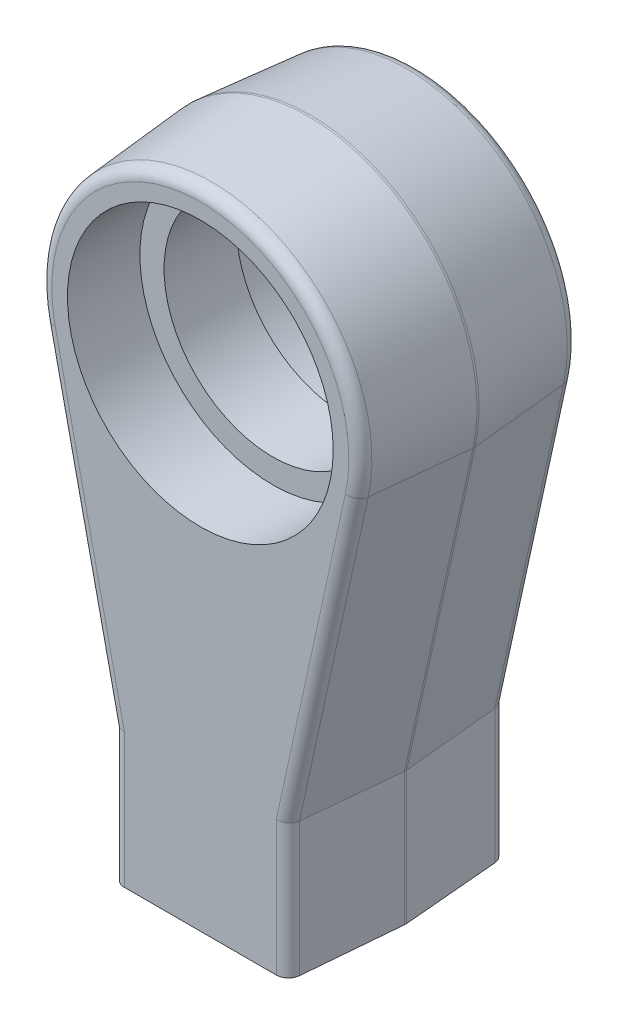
ISO-10303-21;
HEADER;
FILE_DESCRIPTION(('STEP AP214'),'2;1');
FILE_NAME('part.step','',(''),(''),'','','');
FILE_SCHEMA(('AUTOMOTIVE_DESIGN { 1 0 10303 214 1 1 1 1 }'));
ENDSEC;
DATA;
#1=APPLICATION_CONTEXT('core data for automotive mechanical design processes');
#2=APPLICATION_PROTOCOL_DEFINITION('international standard','automotive_design',2000,#1);
#3=PRODUCT_CONTEXT('',#1,'mechanical');
#4=PRODUCT('Part','Part','',(#3));
#5=PRODUCT_RELATED_PRODUCT_CATEGORY('part','',(#4));
#6=PRODUCT_DEFINITION_FORMATION('','',#4);
#7=PRODUCT_DEFINITION_CONTEXT('part definition',#1,'design');
#8=PRODUCT_DEFINITION('design','',#6,#7);
#9=PRODUCT_DEFINITION_SHAPE('','',#8);
#10=(LENGTH_UNIT() NAMED_UNIT(*) SI_UNIT(.MILLI.,.METRE.));
#11=(NAMED_UNIT(*) PLANE_ANGLE_UNIT() SI_UNIT($,.RADIAN.));
#12=(NAMED_UNIT(*) SI_UNIT($,.STERADIAN.) SOLID_ANGLE_UNIT());
#13=UNCERTAINTY_MEASURE_WITH_UNIT(LENGTH_MEASURE(1.E-05),#10,'distance_accuracy_value','');
#14=(GEOMETRIC_REPRESENTATION_CONTEXT(3) GLOBAL_UNCERTAINTY_ASSIGNED_CONTEXT((#13)) GLOBAL_UNIT_ASSIGNED_CONTEXT((#10,
#11,#12)) REPRESENTATION_CONTEXT('',''));
#15=CARTESIAN_POINT('',(0.,0.,0.));
#16=DIRECTION('',(0.,0.,1.));
#17=DIRECTION('',(1.,0.,0.));
#18=AXIS2_PLACEMENT_3D('',#15,#16,#17);
#19=CARTESIAN_POINT('',(0.,0.,-4.5));
#20=DIRECTION('',(0.,0.,1.));
#21=DIRECTION('',(1.,0.,0.));
#22=AXIS2_PLACEMENT_3D('',#19,#20,#21);
#23=CYLINDRICAL_SURFACE('',#22,4.5);
#24=CARTESIAN_POINT('',(0.,0.,1.5));
#25=DIRECTION('',(0.,0.,1.));
#26=DIRECTION('',(1.,0.,0.));
#27=AXIS2_PLACEMENT_3D('',#24,#25,#26);
#28=CIRCLE('',#27,4.5);
#29=CARTESIAN_POINT('',(4.5,0.,1.5));
#30=VERTEX_POINT('',#29);
#31=EDGE_CURVE('E533',#30,#30,#28,.F.);
#32=ORIENTED_EDGE('',*,*,#31,.F.);
#33=EDGE_LOOP('',(#32));
#34=FACE_BOUND('',#33,.T.);
#35=CARTESIAN_POINT('',(0.,0.,-1.5));
#36=DIRECTION('',(0.,0.,-1.));
#37=DIRECTION('',(-1.,0.,0.));
#38=AXIS2_PLACEMENT_3D('',#35,#36,#37);
#39=CIRCLE('',#38,4.5);
#40=CARTESIAN_POINT('',(-4.5,0.,-1.5));
#41=VERTEX_POINT('',#40);
#42=EDGE_CURVE('E537',#41,#41,#39,.F.);
#43=ORIENTED_EDGE('',*,*,#42,.F.);
#44=EDGE_LOOP('',(#43));
#45=FACE_BOUND('',#44,.T.);
#46=ADVANCED_FACE('F350',(#34,#45),#23,.F.);
#47=CARTESIAN_POINT('',(0.,0.,-4.5));
#48=DIRECTION('',(0.,0.,1.));
#49=DIRECTION('',(1.,0.,0.));
#50=AXIS2_PLACEMENT_3D('',#47,#48,#49);
#51=PLANE('',#50);
#52=DIRECTION('',(0.,1.,0.));
#53=VECTOR('',#52,1.);
#54=CARTESIAN_POINT('',(3.14813542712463,-20.1063010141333,-4.5));
#55=LINE('',#54,#53);
#56=CARTESIAN_POINT('',(3.14813542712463,-14.4081168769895,-4.5));
#57=VERTEX_POINT('',#56);
#58=CARTESIAN_POINT('',(3.14813542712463,-20.,-4.5));
#59=VERTEX_POINT('',#58);
#60=EDGE_CURVE('E487',#57,#59,#55,.F.);
#61=ORIENTED_EDGE('',*,*,#60,.T.);
#62=DIRECTION('',(-1.,0.,0.));
#63=VECTOR('',#62,1.);
#64=CARTESIAN_POINT('',(-5.48954240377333,-20.,-4.5));
#65=LINE('',#64,#63);
#66=CARTESIAN_POINT('',(-3.14813542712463,-20.,-4.5));
#67=VERTEX_POINT('',#66);
#68=EDGE_CURVE('E364',#59,#67,#65,.T.);
#69=ORIENTED_EDGE('',*,*,#68,.T.);
#70=DIRECTION('',(0.,-1.,0.));
#71=VECTOR('',#70,1.);
#72=CARTESIAN_POINT('',(-3.14813542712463,-14.4575351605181,-4.5));
#73=LINE('',#72,#71);
#74=CARTESIAN_POINT('',(-3.14813542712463,-14.4081168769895,-4.5));
#75=VERTEX_POINT('',#74);
#76=EDGE_CURVE('E485',#67,#75,#73,.F.);
#77=ORIENTED_EDGE('',*,*,#76,.T.);
#78=DIRECTION('',(0.213241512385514,-0.976999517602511,0.));
#79=VECTOR('',#78,1.);
#80=CARTESIAN_POINT('',(-6.00672534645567,-1.31103769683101,-4.5));
#81=LINE('',#80,#79);
#82=CARTESIAN_POINT('',(-6.00672534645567,-1.31103769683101,-4.5));
#83=VERTEX_POINT('',#82);
#84=EDGE_CURVE('E495',#75,#83,#81,.F.);
#85=ORIENTED_EDGE('',*,*,#84,.T.);
#86=CARTESIAN_POINT('',(0.,0.,-4.5));
#87=DIRECTION('',(0.,0.,1.));
#88=DIRECTION('',(1.,0.,0.));
#89=AXIS2_PLACEMENT_3D('',#86,#87,#88);
#90=CIRCLE('',#89,6.14813542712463);
#91=CARTESIAN_POINT('',(6.00672534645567,-1.31103769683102,-4.5));
#92=VERTEX_POINT('',#91);
#93=EDGE_CURVE('E498',#83,#92,#90,.F.);
#94=ORIENTED_EDGE('',*,*,#93,.T.);
#95=DIRECTION('',(0.213241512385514,0.976999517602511,0.));
#96=VECTOR('',#95,1.);
#97=CARTESIAN_POINT('',(3.15867345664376,-14.3598352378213,-4.5));
#98=LINE('',#97,#96);
#99=EDGE_CURVE('E372',#92,#57,#98,.F.);
#100=ORIENTED_EDGE('',*,*,#99,.T.);
#101=EDGE_LOOP('',(#61,#69,#77,#85,#94,#100));
#102=FACE_BOUND('',#101,.T.);
#103=CARTESIAN_POINT('',(0.,0.,-4.5));
#104=DIRECTION('',(0.,0.,1.));
#105=DIRECTION('',(1.,0.,0.));
#106=AXIS2_PLACEMENT_3D('',#103,#104,#105);
#107=CIRCLE('',#106,5.5);
#108=CARTESIAN_POINT('',(5.5,0.,-4.5));
#109=VERTEX_POINT('',#108);
#110=EDGE_CURVE('E546',#109,#109,#107,.T.);
#111=ORIENTED_EDGE('',*,*,#110,.T.);
#112=EDGE_LOOP('',(#111));
#113=FACE_BOUND('',#112,.T.);
#114=ADVANCED_FACE('F483',(#102,#113),#51,.F.);
#115=CARTESIAN_POINT('',(-4.,-14.5,0.));
#116=DIRECTION('',(-0.996194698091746,0.,0.0871557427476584));
#117=DIRECTION('',(0.0871557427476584,0.,0.996194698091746));
#118=AXIS2_PLACEMENT_3D('',#115,#116,#117);
#119=PLANE('',#118);
#120=DIRECTION('',(0.,-1.,0.));
#121=VECTOR('',#120,1.);
#122=CARTESIAN_POINT('',(-3.9961874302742,-20.5,0.0435778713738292));
#123=LINE('',#122,#121);
#124=CARTESIAN_POINT('',(-3.9961874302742,-14.4995887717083,0.0435778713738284));
#125=VERTEX_POINT('',#124);
#126=CARTESIAN_POINT('',(-3.9961874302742,-20.,0.0435778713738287));
#127=VERTEX_POINT('',#126);
#128=EDGE_CURVE('E525',#125,#127,#123,.T.);
#129=ORIENTED_EDGE('',*,*,#128,.T.);
#130=DIRECTION('',(-0.0871557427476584,0.,-0.996194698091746));
#131=VECTOR('',#130,1.);
#132=CARTESIAN_POINT('',(-4.,-20.,0.));
#133=LINE('',#132,#131);
#134=CARTESIAN_POINT('',(-3.6462327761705,-20.,4.04357787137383));
#135=VERTEX_POINT('',#134);
#136=EDGE_CURVE('E694',#127,#135,#133,.F.);
#137=ORIENTED_EDGE('',*,*,#136,.T.);
#138=DIRECTION('',(0.,-1.,0.));
#139=VECTOR('',#138,1.);
#140=CARTESIAN_POINT('',(-3.6462327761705,-14.4575351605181,4.04357787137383));
#141=LINE('',#140,#139);
#142=CARTESIAN_POINT('',(-3.6462327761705,-14.4618422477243,4.04357787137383));
#143=VERTEX_POINT('',#142);
#144=EDGE_CURVE('E528',#135,#143,#141,.F.);
#145=ORIENTED_EDGE('',*,*,#144,.T.);
#146=DIRECTION('',(-0.0871518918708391,-0.00940030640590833,-0.996150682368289));
#147=VECTOR('',#146,1.);
#148=CARTESIAN_POINT('',(-4.,-14.5,0.));
#149=LINE('',#148,#147);
#150=EDGE_CURVE('E591',#143,#125,#149,.T.);
#151=ORIENTED_EDGE('',*,*,#150,.T.);
#152=EDGE_LOOP('',(#129,#137,#145,#151));
#153=FACE_BOUND('',#152,.T.);
#154=ADVANCED_FACE('F703',(#153),#119,.T.);
#155=CARTESIAN_POINT('',(4.,-14.5,0.));
#156=DIRECTION('',(0.996194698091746,0.,0.0871557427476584));
#157=DIRECTION('',(0.0871557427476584,0.,-0.996194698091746));
#158=AXIS2_PLACEMENT_3D('',#155,#156,#157);
#159=PLANE('',#158);
#160=DIRECTION('',(0.,1.,0.));
#161=VECTOR('',#160,1.);
#162=CARTESIAN_POINT('',(3.6462327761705,-20.1063010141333,4.04357787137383));
#163=LINE('',#162,#161);
#164=CARTESIAN_POINT('',(3.6462327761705,-14.4618422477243,4.04357787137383));
#165=VERTEX_POINT('',#164);
#166=CARTESIAN_POINT('',(3.6462327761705,-20.,4.04357787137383));
#167=VERTEX_POINT('',#166);
#168=EDGE_CURVE('E517',#165,#167,#163,.F.);
#169=ORIENTED_EDGE('',*,*,#168,.T.);
#170=DIRECTION('',(-0.0871557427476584,0.,0.996194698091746));
#171=VECTOR('',#170,1.);
#172=CARTESIAN_POINT('',(4.,-20.,0.));
#173=LINE('',#172,#171);
#174=CARTESIAN_POINT('',(3.9961874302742,-20.,0.0435778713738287));
#175=VERTEX_POINT('',#174);
#176=EDGE_CURVE('E685',#167,#175,#173,.F.);
#177=ORIENTED_EDGE('',*,*,#176,.T.);
#178=DIRECTION('',(0.,1.,0.));
#179=VECTOR('',#178,1.);
#180=CARTESIAN_POINT('',(3.9961874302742,-14.5,0.0435778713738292));
#181=LINE('',#180,#179);
#182=CARTESIAN_POINT('',(3.9961874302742,-14.4995887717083,0.0435778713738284));
#183=VERTEX_POINT('',#182);
#184=EDGE_CURVE('E515',#175,#183,#181,.T.);
#185=ORIENTED_EDGE('',*,*,#184,.T.);
#186=DIRECTION('',(0.0871518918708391,-0.00940030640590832,-0.996150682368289));
#187=VECTOR('',#186,1.);
#188=CARTESIAN_POINT('',(4.,-14.5,0.));
#189=LINE('',#188,#187);
#190=EDGE_CURVE('E608',#165,#183,#189,.T.);
#191=ORIENTED_EDGE('',*,*,#190,.F.);
#192=EDGE_LOOP('',(#169,#177,#185,#191));
#193=FACE_BOUND('',#192,.T.);
#194=ADVANCED_FACE('F352',(#193),#159,.T.);
#195=CARTESIAN_POINT('',(4.,-14.5,0.));
#196=DIRECTION('',(0.973281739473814,-0.212430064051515,0.0871557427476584));
#197=DIRECTION('',(0.213241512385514,0.976999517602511,0.));
#198=AXIS2_PLACEMENT_3D('',#195,#196,#197);
#199=PLANE('',#198);
#200=DIRECTION('',(0.0851511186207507,-0.0185852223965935,-0.996194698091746));
#201=VECTOR('',#200,1.);
#202=CARTESIAN_POINT('',(6.83899662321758,-1.4926905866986,0.));
#203=LINE('',#202,#201);
#204=CARTESIAN_POINT('',(6.49336621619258,-1.41725272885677,4.04357787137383));
#205=VERTEX_POINT('',#204);
#206=CARTESIAN_POINT('',(6.83527174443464,-1.4918775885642,0.0435778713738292));
#207=VERTEX_POINT('',#206);
#208=EDGE_CURVE('E605',#205,#207,#203,.T.);
#209=ORIENTED_EDGE('',*,*,#208,.F.);
#210=DIRECTION('',(0.213241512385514,0.976999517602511,0.));
#211=VECTOR('',#210,1.);
#212=CARTESIAN_POINT('',(3.64531432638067,-14.4660502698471,4.04357787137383));
#213=LINE('',#212,#211);
#214=EDGE_CURVE('E626',#205,#165,#213,.F.);
#215=ORIENTED_EDGE('',*,*,#214,.T.);
#216=ORIENTED_EDGE('',*,*,#190,.T.);
#217=DIRECTION('',(0.213241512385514,0.976999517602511,0.));
#218=VECTOR('',#217,1.);
#219=CARTESIAN_POINT('',(6.83527174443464,-1.49187758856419,0.0435778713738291));
#220=LINE('',#219,#218);
#221=EDGE_CURVE('E623',#183,#207,#220,.T.);
#222=ORIENTED_EDGE('',*,*,#221,.T.);
#223=EDGE_LOOP('',(#209,#215,#216,#222));
#224=FACE_BOUND('',#223,.T.);
#225=ADVANCED_FACE('F723',(#224),#199,.T.);
#226=CARTESIAN_POINT('',(0.,0.,0.));
#227=DIRECTION('',(0.,0.,-1.));
#228=DIRECTION('',(1.,0.,0.));
#229=AXIS2_PLACEMENT_3D('',#226,#227,#228);
#230=CONICAL_SURFACE('',#229,7.,0.0872664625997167);
#231=DIRECTION('',(-0.0851511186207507,-0.0185852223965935,-0.996194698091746));
#232=VECTOR('',#231,1.);
#233=CARTESIAN_POINT('',(-6.83899662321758,-1.4926905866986,0.));
#234=LINE('',#233,#232);
#235=CARTESIAN_POINT('',(-6.49336621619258,-1.41725272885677,4.04357787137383));
#236=VERTEX_POINT('',#235);
#237=CARTESIAN_POINT('',(-6.83527174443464,-1.49187758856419,0.0435778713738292));
#238=VERTEX_POINT('',#237);
#239=EDGE_CURVE('E602',#236,#238,#234,.T.);
#240=ORIENTED_EDGE('',*,*,#239,.F.);
#241=CARTESIAN_POINT('',(0.,0.,4.04357787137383));
#242=DIRECTION('',(0.,0.,-1.));
#243=DIRECTION('',(-1.,0.,0.));
#244=AXIS2_PLACEMENT_3D('',#241,#242,#243);
#245=CIRCLE('',#244,6.64623277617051);
#246=EDGE_CURVE('E509',#236,#205,#245,.T.);
#247=ORIENTED_EDGE('',*,*,#246,.T.);
#248=ORIENTED_EDGE('',*,*,#208,.T.);
#249=CARTESIAN_POINT('',(0.,0.,0.0435778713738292));
#250=DIRECTION('',(0.,0.,-1.));
#251=DIRECTION('',(-1.,0.,0.));
#252=AXIS2_PLACEMENT_3D('',#249,#250,#251);
#253=CIRCLE('',#252,6.9961874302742);
#254=EDGE_CURVE('E507',#207,#238,#253,.F.);
#255=ORIENTED_EDGE('',*,*,#254,.T.);
#256=EDGE_LOOP('',(#240,#247,#248,#255));
#257=FACE_BOUND('',#256,.T.);
#258=ADVANCED_FACE('F719',(#257),#230,.T.);
#259=CARTESIAN_POINT('',(-4.,-14.5,0.));
#260=DIRECTION('',(-0.973281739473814,-0.212430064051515,0.0871557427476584));
#261=DIRECTION('',(0.213241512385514,-0.976999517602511,0.));
#262=AXIS2_PLACEMENT_3D('',#259,#260,#261);
#263=PLANE('',#262);
#264=ORIENTED_EDGE('',*,*,#150,.F.);
#265=DIRECTION('',(0.213241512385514,-0.976999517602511,0.));
#266=VECTOR('',#265,1.);
#267=CARTESIAN_POINT('',(-6.49336621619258,-1.41725272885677,4.04357787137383));
#268=LINE('',#267,#266);
#269=EDGE_CURVE('E630',#143,#236,#268,.F.);
#270=ORIENTED_EDGE('',*,*,#269,.T.);
#271=ORIENTED_EDGE('',*,*,#239,.T.);
#272=DIRECTION('',(0.213241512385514,-0.976999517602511,0.));
#273=VECTOR('',#272,1.);
#274=CARTESIAN_POINT('',(-3.99627512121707,-14.4991870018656,0.0435778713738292));
#275=LINE('',#274,#273);
#276=EDGE_CURVE('E628',#238,#125,#275,.T.);
#277=ORIENTED_EDGE('',*,*,#276,.T.);
#278=EDGE_LOOP('',(#264,#270,#271,#277));
#279=FACE_BOUND('',#278,.T.);
#280=ADVANCED_FACE('F716',(#279),#263,.T.);
#281=CARTESIAN_POINT('',(0.,0.,4.5));
#282=DIRECTION('',(0.,0.,1.));
#283=DIRECTION('',(1.,0.,0.));
#284=AXIS2_PLACEMENT_3D('',#281,#282,#283);
#285=PLANE('',#284);
#286=DIRECTION('',(-1.,0.,0.));
#287=VECTOR('',#286,1.);
#288=CARTESIAN_POINT('',(-5.48954240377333,-20.,4.5));
#289=LINE('',#288,#287);
#290=CARTESIAN_POINT('',(3.14813542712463,-20.,4.5));
#291=VERTEX_POINT('',#290);
#292=CARTESIAN_POINT('',(-3.14813542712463,-20.,4.5));
#293=VERTEX_POINT('',#292);
#294=EDGE_CURVE('E489',#291,#293,#289,.T.);
#295=ORIENTED_EDGE('',*,*,#294,.F.);
#296=DIRECTION('',(0.,-1.,0.));
#297=VECTOR('',#296,1.);
#298=CARTESIAN_POINT('',(3.14813542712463,-14.4575351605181,4.5));
#299=LINE('',#298,#297);
#300=CARTESIAN_POINT('',(3.14813542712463,-14.4081168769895,4.5));
#301=VERTEX_POINT('',#300);
#302=EDGE_CURVE('E621',#291,#301,#299,.F.);
#303=ORIENTED_EDGE('',*,*,#302,.T.);
#304=DIRECTION('',(-0.213241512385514,-0.976999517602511,0.));
#305=VECTOR('',#304,1.);
#306=CARTESIAN_POINT('',(6.00672534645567,-1.31103769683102,4.5));
#307=LINE('',#306,#305);
#308=CARTESIAN_POINT('',(6.00672534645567,-1.31103769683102,4.5));
#309=VERTEX_POINT('',#308);
#310=EDGE_CURVE('E618',#301,#309,#307,.F.);
#311=ORIENTED_EDGE('',*,*,#310,.T.);
#312=CARTESIAN_POINT('',(0.,0.,4.5));
#313=DIRECTION('',(0.,0.,1.));
#314=DIRECTION('',(1.,0.,0.));
#315=AXIS2_PLACEMENT_3D('',#312,#313,#314);
#316=CIRCLE('',#315,6.14813542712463);
#317=CARTESIAN_POINT('',(-6.00672534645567,-1.31103769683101,4.5));
#318=VERTEX_POINT('',#317);
#319=EDGE_CURVE('E616',#309,#318,#316,.T.);
#320=ORIENTED_EDGE('',*,*,#319,.T.);
#321=DIRECTION('',(-0.213241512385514,0.976999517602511,0.));
#322=VECTOR('',#321,1.);
#323=CARTESIAN_POINT('',(-3.15867345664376,-14.3598352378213,4.5));
#324=LINE('',#323,#322);
#325=CARTESIAN_POINT('',(-3.14813542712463,-14.4081168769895,4.5));
#326=VERTEX_POINT('',#325);
#327=EDGE_CURVE('E614',#318,#326,#324,.F.);
#328=ORIENTED_EDGE('',*,*,#327,.T.);
#329=DIRECTION('',(0.,1.,0.));
#330=VECTOR('',#329,1.);
#331=CARTESIAN_POINT('',(-3.14813542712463,-20.1063010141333,4.5));
#332=LINE('',#331,#330);
#333=EDGE_CURVE('E611',#326,#293,#332,.F.);
#334=ORIENTED_EDGE('',*,*,#333,.T.);
#335=EDGE_LOOP('',(#295,#303,#311,#320,#328,#334));
#336=FACE_BOUND('',#335,.T.);
#337=CARTESIAN_POINT('',(0.,0.,4.5));
#338=DIRECTION('',(0.,0.,1.));
#339=DIRECTION('',(1.,0.,0.));
#340=AXIS2_PLACEMENT_3D('',#337,#338,#339);
#341=CIRCLE('',#340,5.5);
#342=CARTESIAN_POINT('',(5.5,0.,4.5));
#343=VERTEX_POINT('',#342);
#344=EDGE_CURVE('E539',#343,#343,#341,.T.);
#345=ORIENTED_EDGE('',*,*,#344,.F.);
#346=EDGE_LOOP('',(#345));
#347=FACE_BOUND('',#346,.T.);
#348=ADVANCED_FACE('F734',(#336,#347),#285,.T.);
#349=CARTESIAN_POINT('',(-4.,-14.5,0.));
#350=DIRECTION('',(-0.996194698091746,0.,-0.0871557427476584));
#351=DIRECTION('',(-0.0871557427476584,0.,0.996194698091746));
#352=AXIS2_PLACEMENT_3D('',#349,#350,#351);
#353=PLANE('',#352);
#354=DIRECTION('',(0.0871557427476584,0.,-0.996194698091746));
#355=VECTOR('',#354,1.);
#356=CARTESIAN_POINT('',(-4.,-20.,0.));
#357=LINE('',#356,#355);
#358=CARTESIAN_POINT('',(-3.9961874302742,-20.,-0.0435778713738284));
#359=VERTEX_POINT('',#358);
#360=CARTESIAN_POINT('',(-3.6462327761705,-20.,-4.04357787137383));
#361=VERTEX_POINT('',#360);
#362=EDGE_CURVE('E476',#359,#361,#357,.T.);
#363=ORIENTED_EDGE('',*,*,#362,.F.);
#364=DIRECTION('',(0.,1.,0.));
#365=VECTOR('',#364,1.);
#366=CARTESIAN_POINT('',(-3.9961874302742,-14.5,-0.0435778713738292));
#367=LINE('',#366,#365);
#368=CARTESIAN_POINT('',(-3.9961874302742,-14.4995887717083,-0.0435778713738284));
#369=VERTEX_POINT('',#368);
#370=EDGE_CURVE('E530',#359,#369,#367,.T.);
#371=ORIENTED_EDGE('',*,*,#370,.T.);
#372=DIRECTION('',(-0.0871518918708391,-0.00940030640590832,0.996150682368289));
#373=VECTOR('',#372,1.);
#374=CARTESIAN_POINT('',(-4.,-14.5,0.));
#375=LINE('',#374,#373);
#376=CARTESIAN_POINT('',(-3.6462327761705,-14.4618422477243,-4.04357787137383));
#377=VERTEX_POINT('',#376);
#378=EDGE_CURVE('E588',#377,#369,#375,.T.);
#379=ORIENTED_EDGE('',*,*,#378,.F.);
#380=DIRECTION('',(0.,-1.,0.));
#381=VECTOR('',#380,1.);
#382=CARTESIAN_POINT('',(-3.6462327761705,-20.1063010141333,-4.04357787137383));
#383=LINE('',#382,#381);
#384=EDGE_CURVE('E358',#377,#361,#383,.T.);
#385=ORIENTED_EDGE('',*,*,#384,.T.);
#386=EDGE_LOOP('',(#363,#371,#379,#385));
#387=FACE_BOUND('',#386,.T.);
#388=ADVANCED_FACE('F645',(#387),#353,.T.);
#389=CARTESIAN_POINT('',(-4.,-14.5,0.));
#390=DIRECTION('',(-0.973281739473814,-0.212430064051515,-0.0871557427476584));
#391=DIRECTION('',(0.213241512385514,-0.976999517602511,0.));
#392=AXIS2_PLACEMENT_3D('',#389,#390,#391);
#393=PLANE('',#392);
#394=ORIENTED_EDGE('',*,*,#378,.T.);
#395=DIRECTION('',(-0.213241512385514,0.976999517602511,0.));
#396=VECTOR('',#395,1.);
#397=CARTESIAN_POINT('',(-6.83527174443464,-1.49187758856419,-0.0435778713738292));
#398=LINE('',#397,#396);
#399=CARTESIAN_POINT('',(-6.83527174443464,-1.49187758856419,-0.0435778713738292));
#400=VERTEX_POINT('',#399);
#401=EDGE_CURVE('E496',#369,#400,#398,.T.);
#402=ORIENTED_EDGE('',*,*,#401,.T.);
#403=DIRECTION('',(-0.0851511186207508,-0.0185852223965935,0.996194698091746));
#404=VECTOR('',#403,1.);
#405=CARTESIAN_POINT('',(-6.83899662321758,-1.4926905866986,0.));
#406=LINE('',#405,#404);
#407=CARTESIAN_POINT('',(-6.49336621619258,-1.41725272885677,-4.04357787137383));
#408=VERTEX_POINT('',#407);
#409=EDGE_CURVE('E592',#408,#400,#406,.T.);
#410=ORIENTED_EDGE('',*,*,#409,.F.);
#411=DIRECTION('',(0.213241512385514,-0.976999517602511,0.));
#412=VECTOR('',#411,1.);
#413=CARTESIAN_POINT('',(-3.64531432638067,-14.4660502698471,-4.04357787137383));
#414=LINE('',#413,#412);
#415=EDGE_CURVE('E500',#408,#377,#414,.T.);
#416=ORIENTED_EDGE('',*,*,#415,.T.);
#417=EDGE_LOOP('',(#394,#402,#410,#416));
#418=FACE_BOUND('',#417,.T.);
#419=ADVANCED_FACE('F640',(#418),#393,.T.);
#420=CARTESIAN_POINT('',(0.,0.,0.));
#421=DIRECTION('',(0.,0.,1.));
#422=DIRECTION('',(1.,0.,0.));
#423=AXIS2_PLACEMENT_3D('',#420,#421,#422);
#424=CONICAL_SURFACE('',#423,7.,0.0872664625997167);
#425=ORIENTED_EDGE('',*,*,#409,.T.);
#426=CARTESIAN_POINT('',(0.,0.,-0.0435778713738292));
#427=DIRECTION('',(0.,0.,1.));
#428=DIRECTION('',(1.,0.,0.));
#429=AXIS2_PLACEMENT_3D('',#426,#427,#428);
#430=CIRCLE('',#429,6.9961874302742);
#431=CARTESIAN_POINT('',(6.83527174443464,-1.49187758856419,-0.0435778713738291));
#432=VERTEX_POINT('',#431);
#433=EDGE_CURVE('E513',#400,#432,#430,.F.);
#434=ORIENTED_EDGE('',*,*,#433,.T.);
#435=DIRECTION('',(0.0851511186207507,-0.0185852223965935,0.996194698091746));
#436=VECTOR('',#435,1.);
#437=CARTESIAN_POINT('',(6.83899662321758,-1.4926905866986,0.));
#438=LINE('',#437,#436);
#439=CARTESIAN_POINT('',(6.49336621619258,-1.41725272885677,-4.04357787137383));
#440=VERTEX_POINT('',#439);
#441=EDGE_CURVE('E595',#440,#432,#438,.T.);
#442=ORIENTED_EDGE('',*,*,#441,.F.);
#443=CARTESIAN_POINT('',(0.,0.,-4.04357787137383));
#444=DIRECTION('',(0.,0.,1.));
#445=DIRECTION('',(1.,0.,0.));
#446=AXIS2_PLACEMENT_3D('',#443,#444,#445);
#447=CIRCLE('',#446,6.64623277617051);
#448=EDGE_CURVE('E511',#440,#408,#447,.T.);
#449=ORIENTED_EDGE('',*,*,#448,.T.);
#450=EDGE_LOOP('',(#425,#434,#442,#449));
#451=FACE_BOUND('',#450,.T.);
#452=ADVANCED_FACE('F663',(#451),#424,.T.);
#453=CARTESIAN_POINT('',(4.,-14.5,0.));
#454=DIRECTION('',(0.973281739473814,-0.212430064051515,-0.0871557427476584));
#455=DIRECTION('',(0.213241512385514,0.976999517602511,0.));
#456=AXIS2_PLACEMENT_3D('',#453,#454,#455);
#457=PLANE('',#456);
#458=ORIENTED_EDGE('',*,*,#441,.T.);
#459=DIRECTION('',(-0.213241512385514,-0.976999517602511,0.));
#460=VECTOR('',#459,1.);
#461=CARTESIAN_POINT('',(3.99627512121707,-14.4991870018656,-0.0435778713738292));
#462=LINE('',#461,#460);
#463=CARTESIAN_POINT('',(3.9961874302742,-14.4995887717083,-0.0435778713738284));
#464=VERTEX_POINT('',#463);
#465=EDGE_CURVE('E635',#432,#464,#462,.T.);
#466=ORIENTED_EDGE('',*,*,#465,.T.);
#467=DIRECTION('',(0.0871518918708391,-0.00940030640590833,0.996150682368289));
#468=VECTOR('',#467,1.);
#469=CARTESIAN_POINT('',(4.,-14.5,0.));
#470=LINE('',#469,#468);
#471=CARTESIAN_POINT('',(3.6462327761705,-14.4618422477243,-4.04357787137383));
#472=VERTEX_POINT('',#471);
#473=EDGE_CURVE('E587',#472,#464,#470,.T.);
#474=ORIENTED_EDGE('',*,*,#473,.F.);
#475=DIRECTION('',(0.213241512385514,0.976999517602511,0.));
#476=VECTOR('',#475,1.);
#477=CARTESIAN_POINT('',(6.49336621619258,-1.41725272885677,-4.04357787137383));
#478=LINE('',#477,#476);
#479=EDGE_CURVE('E632',#472,#440,#478,.T.);
#480=ORIENTED_EDGE('',*,*,#479,.T.);
#481=EDGE_LOOP('',(#458,#466,#474,#480));
#482=FACE_BOUND('',#481,.T.);
#483=ADVANCED_FACE('F661',(#482),#457,.T.);
#484=CARTESIAN_POINT('',(4.,-14.5,0.));
#485=DIRECTION('',(0.996194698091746,0.,-0.0871557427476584));
#486=DIRECTION('',(-0.0871557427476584,0.,-0.996194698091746));
#487=AXIS2_PLACEMENT_3D('',#484,#485,#486);
#488=PLANE('',#487);
#489=DIRECTION('',(0.0871557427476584,0.,0.996194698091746));
#490=VECTOR('',#489,1.);
#491=CARTESIAN_POINT('',(4.,-20.,0.));
#492=LINE('',#491,#490);
#493=CARTESIAN_POINT('',(3.6462327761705,-20.,-4.04357787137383));
#494=VERTEX_POINT('',#493);
#495=CARTESIAN_POINT('',(3.9961874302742,-20.,-0.0435778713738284));
#496=VERTEX_POINT('',#495);
#497=EDGE_CURVE('E488',#494,#496,#492,.T.);
#498=ORIENTED_EDGE('',*,*,#497,.F.);
#499=DIRECTION('',(0.,1.,0.));
#500=VECTOR('',#499,1.);
#501=CARTESIAN_POINT('',(3.6462327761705,-14.4575351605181,-4.04357787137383));
#502=LINE('',#501,#500);
#503=EDGE_CURVE('E520',#494,#472,#502,.T.);
#504=ORIENTED_EDGE('',*,*,#503,.T.);
#505=ORIENTED_EDGE('',*,*,#473,.T.);
#506=DIRECTION('',(0.,-1.,0.));
#507=VECTOR('',#506,1.);
#508=CARTESIAN_POINT('',(3.9961874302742,-20.5,-0.0435778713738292));
#509=LINE('',#508,#507);
#510=EDGE_CURVE('E522',#464,#496,#509,.T.);
#511=ORIENTED_EDGE('',*,*,#510,.T.);
#512=EDGE_LOOP('',(#498,#504,#505,#511));
#513=FACE_BOUND('',#512,.T.);
#514=ADVANCED_FACE('F677',(#513),#488,.T.);
#515=CARTESIAN_POINT('',(-3.14813542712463,0.,4.));
#516=DIRECTION('',(0.,-1.,0.));
#517=DIRECTION('',(1.,0.,0.));
#518=AXIS2_PLACEMENT_3D('',#515,#516,#517);
#519=CYLINDRICAL_SURFACE('',#518,0.5);
#520=CARTESIAN_POINT('',(-3.14813542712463,-20.,4.));
#521=DIRECTION('',(0.,1.,0.));
#522=DIRECTION('',(0.,0.,1.));
#523=AXIS2_PLACEMENT_3D('',#520,#521,#522);
#524=CIRCLE('',#523,0.5);
#525=EDGE_CURVE('E551',#293,#135,#524,.F.);
#526=ORIENTED_EDGE('',*,*,#525,.F.);
#527=ORIENTED_EDGE('',*,*,#333,.F.);
#528=CARTESIAN_POINT('',(-3.14813542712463,-14.4081168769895,4.));
#529=DIRECTION('',(0.107239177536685,-0.994233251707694,0.));
#530=DIRECTION('',(0.994233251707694,0.107239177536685,0.));
#531=AXIS2_PLACEMENT_3D('',#528,#529,#530);
#532=ELLIPSE('',#531,0.502900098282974,0.5);
#533=EDGE_CURVE('E584',#143,#326,#532,.F.);
#534=ORIENTED_EDGE('',*,*,#533,.F.);
#535=ORIENTED_EDGE('',*,*,#144,.F.);
#536=EDGE_LOOP('',(#526,#527,#534,#535));
#537=FACE_BOUND('',#536,.T.);
#538=ADVANCED_FACE('F707',(#537),#519,.T.);
#539=CARTESIAN_POINT('',(-6.00672534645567,-1.31103769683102,4.));
#540=DIRECTION('',(0.213241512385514,-0.976999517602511,0.));
#541=DIRECTION('',(0.976999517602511,0.213241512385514,0.));
#542=AXIS2_PLACEMENT_3D('',#539,#540,#541);
#543=CYLINDRICAL_SURFACE('',#542,0.5);
#544=ORIENTED_EDGE('',*,*,#533,.T.);
#545=ORIENTED_EDGE('',*,*,#327,.F.);
#546=CARTESIAN_POINT('',(-6.00672534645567,-1.31103769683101,4.));
#547=DIRECTION('',(-0.213241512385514,0.976999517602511,0.));
#548=DIRECTION('',(-0.976999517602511,-0.213241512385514,0.));
#549=AXIS2_PLACEMENT_3D('',#546,#547,#548);
#550=CIRCLE('',#549,0.5);
#551=EDGE_CURVE('E581',#236,#318,#550,.T.);
#552=ORIENTED_EDGE('',*,*,#551,.F.);
#553=ORIENTED_EDGE('',*,*,#269,.F.);
#554=EDGE_LOOP('',(#544,#545,#552,#553));
#555=FACE_BOUND('',#554,.T.);
#556=ADVANCED_FACE('F712',(#555),#543,.T.);
#557=CARTESIAN_POINT('',(3.14813542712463,0.,4.));
#558=DIRECTION('',(0.,1.,0.));
#559=DIRECTION('',(-1.,0.,0.));
#560=AXIS2_PLACEMENT_3D('',#557,#558,#559);
#561=CYLINDRICAL_SURFACE('',#560,0.5);
#562=CARTESIAN_POINT('',(3.14813542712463,-20.,4.));
#563=DIRECTION('',(0.,1.,0.));
#564=DIRECTION('',(0.,0.,1.));
#565=AXIS2_PLACEMENT_3D('',#562,#563,#564);
#566=CIRCLE('',#565,0.5);
#567=EDGE_CURVE('E481',#167,#291,#566,.F.);
#568=ORIENTED_EDGE('',*,*,#567,.F.);
#569=ORIENTED_EDGE('',*,*,#168,.F.);
#570=CARTESIAN_POINT('',(3.14813542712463,-14.4081168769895,4.));
#571=DIRECTION('',(0.107239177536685,0.994233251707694,0.));
#572=DIRECTION('',(0.994233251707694,-0.107239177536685,0.));
#573=AXIS2_PLACEMENT_3D('',#570,#571,#572);
#574=ELLIPSE('',#573,0.502900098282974,0.5);
#575=EDGE_CURVE('E578',#301,#165,#574,.T.);
#576=ORIENTED_EDGE('',*,*,#575,.F.);
#577=ORIENTED_EDGE('',*,*,#302,.F.);
#578=EDGE_LOOP('',(#568,#569,#576,#577));
#579=FACE_BOUND('',#578,.T.);
#580=ADVANCED_FACE('F740',(#579),#561,.T.);
#581=CARTESIAN_POINT('',(0.,0.,4.));
#582=DIRECTION('',(0.,0.,1.));
#583=DIRECTION('',(1.,0.,0.));
#584=AXIS2_PLACEMENT_3D('',#581,#582,#583);
#585=TOROIDAL_SURFACE('',#584,6.14813542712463,0.5);
#586=ORIENTED_EDGE('',*,*,#551,.T.);
#587=ORIENTED_EDGE('',*,*,#319,.F.);
#588=CARTESIAN_POINT('',(6.00672534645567,-1.31103769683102,4.));
#589=DIRECTION('',(-0.213241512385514,-0.976999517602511,0.));
#590=DIRECTION('',(0.976999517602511,-0.213241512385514,0.));
#591=AXIS2_PLACEMENT_3D('',#588,#589,#590);
#592=CIRCLE('',#591,0.5);
#593=EDGE_CURVE('E576',#205,#309,#592,.T.);
#594=ORIENTED_EDGE('',*,*,#593,.F.);
#595=ORIENTED_EDGE('',*,*,#246,.F.);
#596=EDGE_LOOP('',(#586,#587,#594,#595));
#597=FACE_BOUND('',#596,.T.);
#598=ADVANCED_FACE('F732',(#597),#585,.T.);
#599=CARTESIAN_POINT('',(6.00672534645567,-1.31103769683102,4.));
#600=DIRECTION('',(0.213241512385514,0.976999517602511,0.));
#601=DIRECTION('',(-0.976999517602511,0.213241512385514,0.));
#602=AXIS2_PLACEMENT_3D('',#599,#600,#601);
#603=CYLINDRICAL_SURFACE('',#602,0.5);
#604=ORIENTED_EDGE('',*,*,#575,.T.);
#605=ORIENTED_EDGE('',*,*,#214,.F.);
#606=ORIENTED_EDGE('',*,*,#593,.T.);
#607=ORIENTED_EDGE('',*,*,#310,.F.);
#608=EDGE_LOOP('',(#604,#605,#606,#607));
#609=FACE_BOUND('',#608,.T.);
#610=ADVANCED_FACE('F727',(#609),#603,.T.);
#611=CARTESIAN_POINT('',(-3.49809008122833,-14.5,0.));
#612=DIRECTION('',(0.,-1.,0.));
#613=DIRECTION('',(1.,0.,0.));
#614=AXIS2_PLACEMENT_3D('',#611,#612,#613);
#615=CYLINDRICAL_SURFACE('',#614,0.5);
#616=CARTESIAN_POINT('',(-3.49809008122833,-20.,0.));
#617=DIRECTION('',(0.,1.,0.));
#618=DIRECTION('',(0.,0.,1.));
#619=AXIS2_PLACEMENT_3D('',#616,#617,#618);
#620=CIRCLE('',#619,0.5);
#621=EDGE_CURVE('E692',#127,#359,#620,.F.);
#622=ORIENTED_EDGE('',*,*,#621,.F.);
#623=ORIENTED_EDGE('',*,*,#128,.F.);
#624=CARTESIAN_POINT('',(-3.49809008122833,-14.4458634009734,0.));
#625=DIRECTION('',(0.107239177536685,-0.994233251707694,0.));
#626=DIRECTION('',(0.994233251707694,0.107239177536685,0.));
#627=AXIS2_PLACEMENT_3D('',#624,#625,#626);
#628=ELLIPSE('',#627,0.502900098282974,0.5);
#629=EDGE_CURVE('E573',#369,#125,#628,.F.);
#630=ORIENTED_EDGE('',*,*,#629,.F.);
#631=ORIENTED_EDGE('',*,*,#370,.F.);
#632=EDGE_LOOP('',(#622,#623,#630,#631));
#633=FACE_BOUND('',#632,.T.);
#634=ADVANCED_FACE('F783',(#633),#615,.T.);
#635=CARTESIAN_POINT('',(-3.50963425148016,-14.3929719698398,0.));
#636=DIRECTION('',(0.213241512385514,-0.976999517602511,0.));
#637=DIRECTION('',(0.976999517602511,0.213241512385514,0.));
#638=AXIS2_PLACEMENT_3D('',#635,#636,#637);
#639=CYLINDRICAL_SURFACE('',#638,0.5);
#640=ORIENTED_EDGE('',*,*,#629,.T.);
#641=ORIENTED_EDGE('',*,*,#276,.F.);
#642=CARTESIAN_POINT('',(-6.34863087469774,-1.38566255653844,0.));
#643=DIRECTION('',(-0.213241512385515,0.97699951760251,0.));
#644=DIRECTION('',(-0.97699951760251,-0.213241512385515,0.));
#645=AXIS2_PLACEMENT_3D('',#642,#643,#644);
#646=CIRCLE('',#645,0.5);
#647=EDGE_CURVE('E570',#400,#238,#646,.T.);
#648=ORIENTED_EDGE('',*,*,#647,.F.);
#649=ORIENTED_EDGE('',*,*,#401,.F.);
#650=EDGE_LOOP('',(#640,#641,#648,#649));
#651=FACE_BOUND('',#650,.T.);
#652=ADVANCED_FACE('F780',(#651),#639,.T.);
#653=CARTESIAN_POINT('',(3.49809008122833,-14.5,0.));
#654=DIRECTION('',(0.,1.,0.));
#655=DIRECTION('',(-1.,0.,0.));
#656=AXIS2_PLACEMENT_3D('',#653,#654,#655);
#657=CYLINDRICAL_SURFACE('',#656,0.5);
#658=CARTESIAN_POINT('',(3.49809008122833,-20.,0.));
#659=DIRECTION('',(0.,1.,0.));
#660=DIRECTION('',(0.,0.,1.));
#661=AXIS2_PLACEMENT_3D('',#658,#659,#660);
#662=CIRCLE('',#661,0.5);
#663=EDGE_CURVE('E683',#496,#175,#662,.F.);
#664=ORIENTED_EDGE('',*,*,#663,.F.);
#665=ORIENTED_EDGE('',*,*,#510,.F.);
#666=CARTESIAN_POINT('',(3.49809008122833,-14.4458634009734,0.));
#667=DIRECTION('',(0.107239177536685,0.994233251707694,0.));
#668=DIRECTION('',(0.994233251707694,-0.107239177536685,0.));
#669=AXIS2_PLACEMENT_3D('',#666,#667,#668);
#670=ELLIPSE('',#669,0.502900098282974,0.5);
#671=EDGE_CURVE('E567',#183,#464,#670,.T.);
#672=ORIENTED_EDGE('',*,*,#671,.F.);
#673=ORIENTED_EDGE('',*,*,#184,.F.);
#674=EDGE_LOOP('',(#664,#665,#672,#673));
#675=FACE_BOUND('',#674,.T.);
#676=ADVANCED_FACE('F681',(#675),#657,.T.);
#677=CARTESIAN_POINT('',(0.,0.,0.));
#678=DIRECTION('',(0.,0.,-1.));
#679=DIRECTION('',(-1.,0.,0.));
#680=AXIS2_PLACEMENT_3D('',#677,#678,#679);
#681=TOROIDAL_SURFACE('',#680,6.49809008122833,0.5);
#682=ORIENTED_EDGE('',*,*,#647,.T.);
#683=ORIENTED_EDGE('',*,*,#254,.F.);
#684=CARTESIAN_POINT('',(6.34863087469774,-1.38566255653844,0.));
#685=DIRECTION('',(-0.213241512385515,-0.97699951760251,0.));
#686=DIRECTION('',(0.97699951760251,-0.213241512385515,0.));
#687=AXIS2_PLACEMENT_3D('',#684,#685,#686);
#688=CIRCLE('',#687,0.5);
#689=EDGE_CURVE('E565',#432,#207,#688,.T.);
#690=ORIENTED_EDGE('',*,*,#689,.F.);
#691=ORIENTED_EDGE('',*,*,#433,.F.);
#692=EDGE_LOOP('',(#682,#683,#690,#691));
#693=FACE_BOUND('',#692,.T.);
#694=ADVANCED_FACE('F668',(#693),#681,.T.);
#695=CARTESIAN_POINT('',(3.50963425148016,-14.3929719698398,0.));
#696=DIRECTION('',(0.213241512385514,0.976999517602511,0.));
#697=DIRECTION('',(-0.976999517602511,0.213241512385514,0.));
#698=AXIS2_PLACEMENT_3D('',#695,#696,#697);
#699=CYLINDRICAL_SURFACE('',#698,0.5);
#700=ORIENTED_EDGE('',*,*,#671,.T.);
#701=ORIENTED_EDGE('',*,*,#465,.F.);
#702=ORIENTED_EDGE('',*,*,#689,.T.);
#703=ORIENTED_EDGE('',*,*,#221,.F.);
#704=EDGE_LOOP('',(#700,#701,#702,#703));
#705=FACE_BOUND('',#704,.T.);
#706=ADVANCED_FACE('F672',(#705),#699,.T.);
#707=CARTESIAN_POINT('',(-3.14813542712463,-14.5,-4.));
#708=DIRECTION('',(0.,1.,0.));
#709=DIRECTION('',(-1.,0.,0.));
#710=AXIS2_PLACEMENT_3D('',#707,#708,#709);
#711=CYLINDRICAL_SURFACE('',#710,0.5);
#712=CARTESIAN_POINT('',(-3.14813542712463,-20.,-4.));
#713=DIRECTION('',(0.,1.,0.));
#714=DIRECTION('',(0.,0.,1.));
#715=AXIS2_PLACEMENT_3D('',#712,#713,#714);
#716=CIRCLE('',#715,0.5);
#717=EDGE_CURVE('E473',#361,#67,#716,.F.);
#718=ORIENTED_EDGE('',*,*,#717,.F.);
#719=ORIENTED_EDGE('',*,*,#384,.F.);
#720=CARTESIAN_POINT('',(-3.14813542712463,-14.4081168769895,-4.));
#721=DIRECTION('',(-0.107239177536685,0.994233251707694,0.));
#722=DIRECTION('',(-0.994233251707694,-0.107239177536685,0.));
#723=AXIS2_PLACEMENT_3D('',#720,#721,#722);
#724=ELLIPSE('',#723,0.502900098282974,0.5);
#725=EDGE_CURVE('E493',#75,#377,#724,.T.);
#726=ORIENTED_EDGE('',*,*,#725,.F.);
#727=ORIENTED_EDGE('',*,*,#76,.F.);
#728=EDGE_LOOP('',(#718,#719,#726,#727));
#729=FACE_BOUND('',#728,.T.);
#730=ADVANCED_FACE('F491',(#729),#711,.T.);
#731=CARTESIAN_POINT('',(-3.1677287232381,-14.3183471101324,-4.));
#732=DIRECTION('',(-0.213241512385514,0.976999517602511,0.));
#733=DIRECTION('',(-0.976999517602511,-0.213241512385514,0.));
#734=AXIS2_PLACEMENT_3D('',#731,#732,#733);
#735=CYLINDRICAL_SURFACE('',#734,0.5);
#736=ORIENTED_EDGE('',*,*,#725,.T.);
#737=ORIENTED_EDGE('',*,*,#415,.F.);
#738=CARTESIAN_POINT('',(-6.00672534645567,-1.31103769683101,-4.));
#739=DIRECTION('',(-0.213241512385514,0.976999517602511,0.));
#740=DIRECTION('',(-0.976999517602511,-0.213241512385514,0.));
#741=AXIS2_PLACEMENT_3D('',#738,#739,#740);
#742=CIRCLE('',#741,0.5);
#743=EDGE_CURVE('E561',#83,#408,#742,.T.);
#744=ORIENTED_EDGE('',*,*,#743,.F.);
#745=ORIENTED_EDGE('',*,*,#84,.F.);
#746=EDGE_LOOP('',(#736,#737,#744,#745));
#747=FACE_BOUND('',#746,.T.);
#748=ADVANCED_FACE('F647',(#747),#735,.T.);
#749=CARTESIAN_POINT('',(3.14813542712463,-14.5,-4.));
#750=DIRECTION('',(0.,-1.,0.));
#751=DIRECTION('',(1.,0.,0.));
#752=AXIS2_PLACEMENT_3D('',#749,#750,#751);
#753=CYLINDRICAL_SURFACE('',#752,0.5);
#754=CARTESIAN_POINT('',(3.14813542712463,-20.,-4.));
#755=DIRECTION('',(0.,1.,0.));
#756=DIRECTION('',(0.,0.,1.));
#757=AXIS2_PLACEMENT_3D('',#754,#755,#756);
#758=CIRCLE('',#757,0.5);
#759=EDGE_CURVE('E11',#59,#494,#758,.F.);
#760=ORIENTED_EDGE('',*,*,#759,.F.);
#761=ORIENTED_EDGE('',*,*,#60,.F.);
#762=CARTESIAN_POINT('',(3.14813542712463,-14.4081168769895,-4.));
#763=DIRECTION('',(-0.107239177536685,-0.994233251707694,0.));
#764=DIRECTION('',(-0.994233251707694,0.107239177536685,0.));
#765=AXIS2_PLACEMENT_3D('',#762,#763,#764);
#766=ELLIPSE('',#765,0.502900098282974,0.5);
#767=EDGE_CURVE('E558',#472,#57,#766,.F.);
#768=ORIENTED_EDGE('',*,*,#767,.F.);
#769=ORIENTED_EDGE('',*,*,#503,.F.);
#770=EDGE_LOOP('',(#760,#761,#768,#769));
#771=FACE_BOUND('',#770,.T.);
#772=ADVANCED_FACE('F766',(#771),#753,.T.);
#773=CARTESIAN_POINT('',(0.,0.,-4.));
#774=DIRECTION('',(0.,0.,1.));
#775=DIRECTION('',(1.,0.,0.));
#776=AXIS2_PLACEMENT_3D('',#773,#774,#775);
#777=TOROIDAL_SURFACE('',#776,6.14813542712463,0.5);
#778=ORIENTED_EDGE('',*,*,#743,.T.);
#779=ORIENTED_EDGE('',*,*,#448,.F.);
#780=CARTESIAN_POINT('',(6.00672534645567,-1.31103769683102,-4.));
#781=DIRECTION('',(-0.213241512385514,-0.976999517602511,0.));
#782=DIRECTION('',(0.976999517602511,-0.213241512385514,0.));
#783=AXIS2_PLACEMENT_3D('',#780,#781,#782);
#784=CIRCLE('',#783,0.5);
#785=EDGE_CURVE('E535',#92,#440,#784,.T.);
#786=ORIENTED_EDGE('',*,*,#785,.F.);
#787=ORIENTED_EDGE('',*,*,#93,.F.);
#788=EDGE_LOOP('',(#778,#779,#786,#787));
#789=FACE_BOUND('',#788,.T.);
#790=ADVANCED_FACE('F656',(#789),#777,.T.);
#791=CARTESIAN_POINT('',(3.1677287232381,-14.3183471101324,-4.));
#792=DIRECTION('',(-0.213241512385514,-0.976999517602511,0.));
#793=DIRECTION('',(0.976999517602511,-0.213241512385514,0.));
#794=AXIS2_PLACEMENT_3D('',#791,#792,#793);
#795=CYLINDRICAL_SURFACE('',#794,0.5);
#796=ORIENTED_EDGE('',*,*,#767,.T.);
#797=ORIENTED_EDGE('',*,*,#99,.F.);
#798=ORIENTED_EDGE('',*,*,#785,.T.);
#799=ORIENTED_EDGE('',*,*,#479,.F.);
#800=EDGE_LOOP('',(#796,#797,#798,#799));
#801=FACE_BOUND('',#800,.T.);
#802=ADVANCED_FACE('F652',(#801),#795,.T.);
#803=CARTESIAN_POINT('',(0.,0.,1.5));
#804=DIRECTION('',(0.,0.,1.));
#805=DIRECTION('',(1.,0.,0.));
#806=AXIS2_PLACEMENT_3D('',#803,#804,#805);
#807=PLANE('',#806);
#808=CARTESIAN_POINT('',(0.,0.,1.5));
#809=DIRECTION('',(0.,0.,1.));
#810=DIRECTION('',(1.,0.,0.));
#811=AXIS2_PLACEMENT_3D('',#808,#809,#810);
#812=CIRCLE('',#811,5.5);
#813=CARTESIAN_POINT('',(5.5,0.,1.5));
#814=VERTEX_POINT('',#813);
#815=EDGE_CURVE('E536',#814,#814,#812,.T.);
#816=ORIENTED_EDGE('',*,*,#815,.T.);
#817=EDGE_LOOP('',(#816));
#818=FACE_BOUND('',#817,.T.);
#819=ORIENTED_EDGE('',*,*,#31,.T.);
#820=EDGE_LOOP('',(#819));
#821=FACE_BOUND('',#820,.T.);
#822=ADVANCED_FACE('F763',(#818,#821),#807,.T.);
#823=CARTESIAN_POINT('',(0.,0.,1.5));
#824=DIRECTION('',(0.,0.,1.));
#825=DIRECTION('',(1.,0.,0.));
#826=AXIS2_PLACEMENT_3D('',#823,#824,#825);
#827=CYLINDRICAL_SURFACE('',#826,5.5);
#828=ORIENTED_EDGE('',*,*,#815,.F.);
#829=EDGE_LOOP('',(#828));
#830=FACE_BOUND('',#829,.T.);
#831=ORIENTED_EDGE('',*,*,#344,.T.);
#832=EDGE_LOOP('',(#831));
#833=FACE_BOUND('',#832,.T.);
#834=ADVANCED_FACE('F759',(#830,#833),#827,.F.);
#835=CARTESIAN_POINT('',(0.,0.,-1.5));
#836=DIRECTION('',(0.,0.,-1.));
#837=DIRECTION('',(1.,0.,0.));
#838=AXIS2_PLACEMENT_3D('',#835,#836,#837);
#839=PLANE('',#838);
#840=CARTESIAN_POINT('',(0.,0.,-1.5));
#841=DIRECTION('',(0.,0.,1.));
#842=DIRECTION('',(1.,0.,0.));
#843=AXIS2_PLACEMENT_3D('',#840,#841,#842);
#844=CIRCLE('',#843,5.5);
#845=CARTESIAN_POINT('',(5.5,0.,-1.5));
#846=VERTEX_POINT('',#845);
#847=EDGE_CURVE('E540',#846,#846,#844,.T.);
#848=ORIENTED_EDGE('',*,*,#847,.F.);
#849=EDGE_LOOP('',(#848));
#850=FACE_BOUND('',#849,.T.);
#851=ORIENTED_EDGE('',*,*,#42,.T.);
#852=EDGE_LOOP('',(#851));
#853=FACE_BOUND('',#852,.T.);
#854=ADVANCED_FACE('F922',(#850,#853),#839,.T.);
#855=CARTESIAN_POINT('',(0.,0.,-1.5));
#856=DIRECTION('',(0.,0.,-1.));
#857=DIRECTION('',(-1.,0.,0.));
#858=AXIS2_PLACEMENT_3D('',#855,#856,#857);
#859=CYLINDRICAL_SURFACE('',#858,5.5);
#860=ORIENTED_EDGE('',*,*,#847,.T.);
#861=EDGE_LOOP('',(#860));
#862=FACE_BOUND('',#861,.T.);
#863=ORIENTED_EDGE('',*,*,#110,.F.);
#864=EDGE_LOOP('',(#863));
#865=FACE_BOUND('',#864,.T.);
#866=ADVANCED_FACE('F930',(#862,#865),#859,.F.);
#867=CARTESIAN_POINT('',(-5.48954240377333,-20.,-4.5));
#868=DIRECTION('',(0.,1.,0.));
#869=DIRECTION('',(0.,0.,1.));
#870=AXIS2_PLACEMENT_3D('',#867,#868,#869);
#871=PLANE('',#870);
#872=CARTESIAN_POINT('',(0.,-20.,0.));
#873=DIRECTION('',(0.,-1.,0.));
#874=DIRECTION('',(0.,0.,-1.));
#875=AXIS2_PLACEMENT_3D('',#872,#873,#874);
#876=CIRCLE('',#875,1.5);
#877=CARTESIAN_POINT('',(0.,-20.,-1.5));
#878=VERTEX_POINT('',#877);
#879=EDGE_CURVE('E966',#878,#878,#876,.T.);
#880=ORIENTED_EDGE('',*,*,#879,.F.);
#881=EDGE_LOOP('',(#880));
#882=FACE_BOUND('',#881,.T.);
#883=ORIENTED_EDGE('',*,*,#525,.T.);
#884=ORIENTED_EDGE('',*,*,#136,.F.);
#885=ORIENTED_EDGE('',*,*,#621,.T.);
#886=ORIENTED_EDGE('',*,*,#362,.T.);
#887=ORIENTED_EDGE('',*,*,#717,.T.);
#888=ORIENTED_EDGE('',*,*,#68,.F.);
#889=ORIENTED_EDGE('',*,*,#759,.T.);
#890=ORIENTED_EDGE('',*,*,#497,.T.);
#891=ORIENTED_EDGE('',*,*,#663,.T.);
#892=ORIENTED_EDGE('',*,*,#176,.F.);
#893=ORIENTED_EDGE('',*,*,#567,.T.);
#894=ORIENTED_EDGE('',*,*,#294,.T.);
#895=EDGE_LOOP('',(#883,#884,#885,#886,#887,#888,#889,#890,#891,#892,#893,#894));
#896=FACE_BOUND('',#895,.T.);
#897=ADVANCED_FACE('F474',(#882,#896),#871,.F.);
#898=CARTESIAN_POINT('',(0.,-12.,0.));
#899=DIRECTION('',(0.,-1.,0.));
#900=DIRECTION('',(0.,0.,-1.));
#901=AXIS2_PLACEMENT_3D('',#898,#899,#900);
#902=CYLINDRICAL_SURFACE('',#901,1.5);
#903=CARTESIAN_POINT('',(0.,-12.,0.));
#904=DIRECTION('',(0.,-1.,0.));
#905=DIRECTION('',(0.,0.,-1.));
#906=AXIS2_PLACEMENT_3D('',#903,#904,#905);
#907=CIRCLE('',#906,1.5);
#908=CARTESIAN_POINT('',(0.,-12.,-1.5));
#909=VERTEX_POINT('',#908);
#910=EDGE_CURVE('E965',#909,#909,#907,.T.);
#911=ORIENTED_EDGE('',*,*,#910,.F.);
#912=EDGE_LOOP('',(#911));
#913=FACE_BOUND('',#912,.T.);
#914=ORIENTED_EDGE('',*,*,#879,.T.);
#915=EDGE_LOOP('',(#914));
#916=FACE_BOUND('',#915,.T.);
#917=ADVANCED_FACE('F944',(#913,#916),#902,.F.);
#918=CARTESIAN_POINT('',(0.,-12.,0.));
#919=DIRECTION('',(0.,-1.,0.));
#920=DIRECTION('',(0.,0.,-1.));
#921=AXIS2_PLACEMENT_3D('',#918,#919,#920);
#922=PLANE('',#921);
#923=ORIENTED_EDGE('',*,*,#910,.T.);
#924=EDGE_LOOP('',(#923));
#925=FACE_BOUND('',#924,.T.);
#926=ADVANCED_FACE('F952',(#925),#922,.T.);
#927=CLOSED_SHELL('',(#46,#114,#154,#194,#225,#258,#280,#348,#388,#419,#452,#483,#514,#538,#556,
#580,#598,#610,#634,#652,#676,#694,#706,#730,#748,#772,#790,#802,#822,#834,#854,#866,#897,#917,#926));
#928=MANIFOLD_SOLID_BREP('B2',#927);
#929=ADVANCED_BREP_SHAPE_REPRESENTATION('',(#18,#928),#14);
#930=SHAPE_DEFINITION_REPRESENTATION(#9,#929);
ENDSEC;
END-ISO-10303-21;
